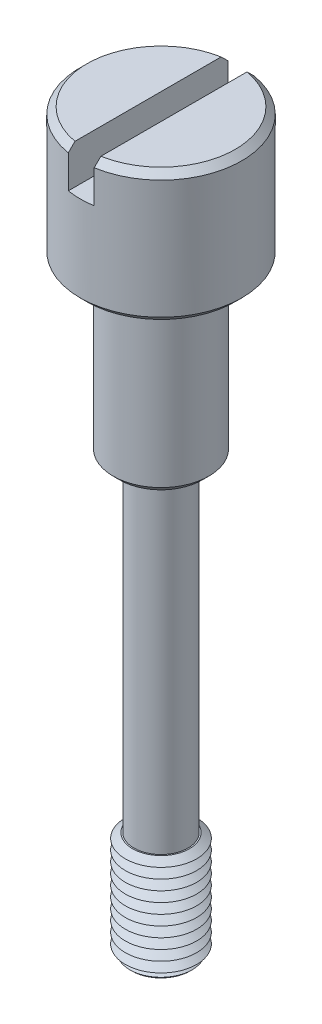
ISO-10303-21;
HEADER;
FILE_DESCRIPTION(('STEP AP214'),'2;1');
FILE_NAME('part.step','',(''),(''),'','','');
FILE_SCHEMA(('AUTOMOTIVE_DESIGN { 1 0 10303 214 1 1 1 1 }'));
ENDSEC;
DATA;
#1=APPLICATION_CONTEXT('core data for automotive mechanical design processes');
#2=APPLICATION_PROTOCOL_DEFINITION('international standard','automotive_design',2000,#1);
#3=PRODUCT_CONTEXT('',#1,'mechanical');
#4=PRODUCT('Part','Part','',(#3));
#5=PRODUCT_RELATED_PRODUCT_CATEGORY('part','',(#4));
#6=PRODUCT_DEFINITION_FORMATION('','',#4);
#7=PRODUCT_DEFINITION_CONTEXT('part definition',#1,'design');
#8=PRODUCT_DEFINITION('design','',#6,#7);
#9=PRODUCT_DEFINITION_SHAPE('','',#8);
#10=(LENGTH_UNIT() NAMED_UNIT(*) SI_UNIT(.MILLI.,.METRE.));
#11=(NAMED_UNIT(*) PLANE_ANGLE_UNIT() SI_UNIT($,.RADIAN.));
#12=(NAMED_UNIT(*) SI_UNIT($,.STERADIAN.) SOLID_ANGLE_UNIT());
#13=UNCERTAINTY_MEASURE_WITH_UNIT(LENGTH_MEASURE(1.E-05),#10,'distance_accuracy_value','');
#14=(GEOMETRIC_REPRESENTATION_CONTEXT(3) GLOBAL_UNCERTAINTY_ASSIGNED_CONTEXT((#13)) GLOBAL_UNIT_ASSIGNED_CONTEXT((#10,
#11,#12)) REPRESENTATION_CONTEXT('',''));
#15=CARTESIAN_POINT('',(0.,0.,0.));
#16=DIRECTION('',(0.,0.,1.));
#17=DIRECTION('',(1.,0.,0.));
#18=AXIS2_PLACEMENT_3D('',#15,#16,#17);
#19=CARTESIAN_POINT('',(0.,-25.7302,0.));
#20=DIRECTION('',(0.,-1.,0.));
#21=DIRECTION('',(0.,0.,-1.));
#22=AXIS2_PLACEMENT_3D('',#19,#20,#21);
#23=PLANE('',#22);
#24=CARTESIAN_POINT('',(0.,-25.7301999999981,0.));
#25=DIRECTION('',(0.,1.,0.));
#26=DIRECTION('',(0.,0.,1.));
#27=AXIS2_PLACEMENT_3D('',#24,#25,#26);
#28=CIRCLE('',#27,1.1175999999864);
#29=CARTESIAN_POINT('',(0.,-25.7301999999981,1.1175999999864));
#30=VERTEX_POINT('',#29);
#31=EDGE_CURVE('E19',#30,#30,#28,.T.);
#32=ORIENTED_EDGE('',*,*,#31,.F.);
#33=EDGE_LOOP('',(#32));
#34=FACE_BOUND('',#33,.T.);
#35=ADVANCED_FACE('F16',(#34),#23,.T.);
#36=CARTESIAN_POINT('',(0.,-25.6517066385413,0.));
#37=DIRECTION('',(0.,1.,0.));
#38=DIRECTION('',(0.,0.,1.));
#39=AXIS2_PLACEMENT_3D('',#36,#37,#38);
#40=CONICAL_SURFACE('',#39,1.19609336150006,0.785398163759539);
#41=ORIENTED_EDGE('',*,*,#31,.T.);
#42=EDGE_LOOP('',(#41));
#43=FACE_BOUND('',#42,.T.);
#44=CARTESIAN_POINT('',(0.,-25.6517066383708,0.));
#45=DIRECTION('',(0.,-1.,0.));
#46=DIRECTION('',(0.,0.,-1.));
#47=AXIS2_PLACEMENT_3D('',#44,#45,#46);
#48=CIRCLE('',#47,1.1960933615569);
#49=CARTESIAN_POINT('',(0.,-25.6517066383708,-1.1960933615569));
#50=VERTEX_POINT('',#49);
#51=EDGE_CURVE('E353',#50,#50,#48,.F.);
#52=ORIENTED_EDGE('',*,*,#51,.F.);
#53=EDGE_LOOP('',(#52));
#54=FACE_BOUND('',#53,.T.);
#55=ADVANCED_FACE('F251',(#43,#54),#40,.T.);
#56=CARTESIAN_POINT('',(0.,-25.6517066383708,0.));
#57=DIRECTION('',(0.,-1.,0.));
#58=DIRECTION('',(0.,0.,-1.));
#59=AXIS2_PLACEMENT_3D('',#56,#57,#58);
#60=CONICAL_SURFACE('',#59,1.1960933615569,0.959931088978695);
#61=CARTESIAN_POINT('',(0.,-25.5789597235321,0.));
#62=DIRECTION('',(0.,1.,0.));
#63=DIRECTION('',(0.,0.,1.));
#64=AXIS2_PLACEMENT_3D('',#61,#62,#63);
#65=CIRCLE('',#64,1.09220000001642);
#66=CARTESIAN_POINT('',(0.,-25.5789597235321,1.09220000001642));
#67=VERTEX_POINT('',#66);
#68=EDGE_CURVE('E350',#67,#67,#65,.T.);
#69=ORIENTED_EDGE('',*,*,#68,.F.);
#70=EDGE_LOOP('',(#69));
#71=FACE_BOUND('',#70,.T.);
#72=ORIENTED_EDGE('',*,*,#51,.T.);
#73=EDGE_LOOP('',(#72));
#74=FACE_BOUND('',#73,.T.);
#75=ADVANCED_FACE('F248',(#71,#74),#60,.T.);
#76=CARTESIAN_POINT('',(0.,-25.383321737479,0.));
#77=DIRECTION('',(0.,1.,0.));
#78=DIRECTION('',(-1.,0.,0.));
#79=AXIS2_PLACEMENT_3D('',#76,#77,#78);
#80=CONICAL_SURFACE('',#79,1.3715999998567,0.959931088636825);
#81=ORIENTED_EDGE('',*,*,#68,.T.);
#82=EDGE_LOOP('',(#81));
#83=FACE_BOUND('',#82,.T.);
#84=CARTESIAN_POINT('',(0.,-25.3833217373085,0.));
#85=DIRECTION('',(0.,-1.,0.));
#86=DIRECTION('',(0.,0.,-1.));
#87=AXIS2_PLACEMENT_3D('',#84,#85,#86);
#88=CIRCLE('',#87,1.37159999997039);
#89=CARTESIAN_POINT('',(0.,-25.3833217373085,-1.37159999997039));
#90=VERTEX_POINT('',#89);
#91=EDGE_CURVE('E347',#90,#90,#88,.F.);
#92=ORIENTED_EDGE('',*,*,#91,.F.);
#93=EDGE_LOOP('',(#92));
#94=FACE_BOUND('',#93,.T.);
#95=ADVANCED_FACE('F244',(#83,#94),#80,.T.);
#96=CARTESIAN_POINT('',(0.,-25.3833217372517,0.));
#97=DIRECTION('',(0.,-1.,0.));
#98=DIRECTION('',(0.,0.,-1.));
#99=AXIS2_PLACEMENT_3D('',#96,#97,#98);
#100=CONICAL_SURFACE('',#99,1.3715999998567,0.959931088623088);
#101=CARTESIAN_POINT('',(0.,-25.1876837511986,0.));
#102=DIRECTION('',(0.,1.,0.));
#103=DIRECTION('',(0.,0.,1.));
#104=AXIS2_PLACEMENT_3D('',#101,#102,#103);
#105=CIRCLE('',#104,1.09219999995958);
#106=CARTESIAN_POINT('',(0.,-25.1876837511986,1.09219999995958));
#107=VERTEX_POINT('',#106);
#108=EDGE_CURVE('E344',#107,#107,#105,.T.);
#109=ORIENTED_EDGE('',*,*,#108,.F.);
#110=EDGE_LOOP('',(#109));
#111=FACE_BOUND('',#110,.T.);
#112=ORIENTED_EDGE('',*,*,#91,.T.);
#113=EDGE_LOOP('',(#112));
#114=FACE_BOUND('',#113,.T.);
#115=ADVANCED_FACE('F240',(#111,#114),#100,.T.);
#116=CARTESIAN_POINT('',(0.,-24.9920457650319,0.));
#117=DIRECTION('',(0.,1.,0.));
#118=DIRECTION('',(0.,0.,1.));
#119=AXIS2_PLACEMENT_3D('',#116,#117,#118);
#120=CONICAL_SURFACE('',#119,1.37159999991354,0.959931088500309);
#121=ORIENTED_EDGE('',*,*,#108,.T.);
#122=EDGE_LOOP('',(#121));
#123=FACE_BOUND('',#122,.T.);
#124=CARTESIAN_POINT('',(0.,-24.992045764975,0.));
#125=DIRECTION('',(0.,-1.,0.));
#126=DIRECTION('',(0.,0.,-1.));
#127=AXIS2_PLACEMENT_3D('',#124,#125,#126);
#128=CIRCLE('',#127,1.37160000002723);
#129=CARTESIAN_POINT('',(0.,-24.992045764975,-1.37160000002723));
#130=VERTEX_POINT('',#129);
#131=EDGE_CURVE('E341',#130,#130,#128,.F.);
#132=ORIENTED_EDGE('',*,*,#131,.F.);
#133=EDGE_LOOP('',(#132));
#134=FACE_BOUND('',#133,.T.);
#135=ADVANCED_FACE('F236',(#123,#134),#120,.T.);
#136=CARTESIAN_POINT('',(0.,-24.9920457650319,0.));
#137=DIRECTION('',(0.,-1.,0.));
#138=DIRECTION('',(0.,0.,-1.));
#139=AXIS2_PLACEMENT_3D('',#136,#137,#138);
#140=CONICAL_SURFACE('',#139,1.37160000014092,0.959931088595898);
#141=CARTESIAN_POINT('',(0.,-24.7964077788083,0.));
#142=DIRECTION('',(0.,1.,0.));
#143=DIRECTION('',(0.,0.,1.));
#144=AXIS2_PLACEMENT_3D('',#141,#142,#143);
#145=CIRCLE('',#144,1.09220000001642);
#146=CARTESIAN_POINT('',(0.,-24.7964077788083,1.09220000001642));
#147=VERTEX_POINT('',#146);
#148=EDGE_CURVE('E338',#147,#147,#145,.T.);
#149=ORIENTED_EDGE('',*,*,#148,.F.);
#150=EDGE_LOOP('',(#149));
#151=FACE_BOUND('',#150,.T.);
#152=ORIENTED_EDGE('',*,*,#131,.T.);
#153=EDGE_LOOP('',(#152));
#154=FACE_BOUND('',#153,.T.);
#155=ADVANCED_FACE('F232',(#151,#154),#140,.T.);
#156=CARTESIAN_POINT('',(0.,-24.6007697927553,0.));
#157=DIRECTION('',(0.,1.,0.));
#158=DIRECTION('',(0.,0.,1.));
#159=AXIS2_PLACEMENT_3D('',#156,#157,#158);
#160=CONICAL_SURFACE('',#159,1.3715999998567,0.959931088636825);
#161=ORIENTED_EDGE('',*,*,#148,.T.);
#162=EDGE_LOOP('',(#161));
#163=FACE_BOUND('',#162,.T.);
#164=CARTESIAN_POINT('',(0.,-24.6007697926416,0.));
#165=DIRECTION('',(0.,-1.,0.));
#166=DIRECTION('',(0.,0.,-1.));
#167=AXIS2_PLACEMENT_3D('',#164,#165,#166);
#168=CIRCLE('',#167,1.37160000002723);
#169=CARTESIAN_POINT('',(0.,-24.6007697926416,-1.37160000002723));
#170=VERTEX_POINT('',#169);
#171=EDGE_CURVE('E335',#170,#170,#168,.F.);
#172=ORIENTED_EDGE('',*,*,#171,.F.);
#173=EDGE_LOOP('',(#172));
#174=FACE_BOUND('',#173,.T.);
#175=ADVANCED_FACE('F228',(#163,#174),#160,.T.);
#176=CARTESIAN_POINT('',(0.,-24.6007697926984,0.));
#177=DIRECTION('',(0.,-1.,0.));
#178=DIRECTION('',(1.,0.,0.));
#179=AXIS2_PLACEMENT_3D('',#176,#177,#178);
#180=CONICAL_SURFACE('',#179,1.37160000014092,0.959931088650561);
#181=CARTESIAN_POINT('',(0.,-24.4051318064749,0.));
#182=DIRECTION('',(0.,1.,0.));
#183=DIRECTION('',(0.,0.,1.));
#184=AXIS2_PLACEMENT_3D('',#181,#182,#183);
#185=CIRCLE('',#184,1.09220000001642);
#186=CARTESIAN_POINT('',(0.,-24.4051318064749,1.09220000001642));
#187=VERTEX_POINT('',#186);
#188=EDGE_CURVE('E332',#187,#187,#185,.T.);
#189=ORIENTED_EDGE('',*,*,#188,.F.);
#190=EDGE_LOOP('',(#189));
#191=FACE_BOUND('',#190,.T.);
#192=ORIENTED_EDGE('',*,*,#171,.T.);
#193=EDGE_LOOP('',(#192));
#194=FACE_BOUND('',#193,.T.);
#195=ADVANCED_FACE('F224',(#191,#194),#180,.T.);
#196=CARTESIAN_POINT('',(0.,-24.2094938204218,0.));
#197=DIRECTION('',(0.,1.,0.));
#198=DIRECTION('',(0.,0.,1.));
#199=AXIS2_PLACEMENT_3D('',#196,#197,#198);
#200=CONICAL_SURFACE('',#199,1.3715999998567,0.959931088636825);
#201=ORIENTED_EDGE('',*,*,#188,.T.);
#202=EDGE_LOOP('',(#201));
#203=FACE_BOUND('',#202,.T.);
#204=CARTESIAN_POINT('',(0.,-24.2094938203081,0.));
#205=DIRECTION('',(0.,-1.,0.));
#206=DIRECTION('',(0.,0.,-1.));
#207=AXIS2_PLACEMENT_3D('',#204,#205,#206);
#208=CIRCLE('',#207,1.37160000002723);
#209=CARTESIAN_POINT('',(0.,-24.2094938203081,-1.37160000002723));
#210=VERTEX_POINT('',#209);
#211=EDGE_CURVE('E329',#210,#210,#208,.F.);
#212=ORIENTED_EDGE('',*,*,#211,.F.);
#213=EDGE_LOOP('',(#212));
#214=FACE_BOUND('',#213,.T.);
#215=ADVANCED_FACE('F220',(#203,#214),#200,.T.);
#216=CARTESIAN_POINT('',(0.,-24.209493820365,0.));
#217=DIRECTION('',(0.,-1.,0.));
#218=DIRECTION('',(0.,0.,-1.));
#219=AXIS2_PLACEMENT_3D('',#216,#217,#218);
#220=CONICAL_SURFACE('',#219,1.37160000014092,0.959931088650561);
#221=CARTESIAN_POINT('',(0.,-24.0138558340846,0.));
#222=DIRECTION('',(0.,1.,0.));
#223=DIRECTION('',(0.,0.,1.));
#224=AXIS2_PLACEMENT_3D('',#221,#222,#223);
#225=CIRCLE('',#224,1.09220000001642);
#226=CARTESIAN_POINT('',(0.,-24.0138558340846,1.09220000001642));
#227=VERTEX_POINT('',#226);
#228=EDGE_CURVE('E326',#227,#227,#225,.T.);
#229=ORIENTED_EDGE('',*,*,#228,.F.);
#230=EDGE_LOOP('',(#229));
#231=FACE_BOUND('',#230,.T.);
#232=ORIENTED_EDGE('',*,*,#211,.T.);
#233=EDGE_LOOP('',(#232));
#234=FACE_BOUND('',#233,.T.);
#235=ADVANCED_FACE('F216',(#231,#234),#220,.T.);
#236=CARTESIAN_POINT('',(0.,-23.8182178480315,0.));
#237=DIRECTION('',(0.,1.,0.));
#238=DIRECTION('',(0.,0.,1.));
#239=AXIS2_PLACEMENT_3D('',#236,#237,#238);
#240=CONICAL_SURFACE('',#239,1.3715999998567,0.959931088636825);
#241=ORIENTED_EDGE('',*,*,#228,.T.);
#242=EDGE_LOOP('',(#241));
#243=FACE_BOUND('',#242,.T.);
#244=CARTESIAN_POINT('',(0.,-23.8182178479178,0.));
#245=DIRECTION('',(0.,-1.,0.));
#246=DIRECTION('',(0.,0.,-1.));
#247=AXIS2_PLACEMENT_3D('',#244,#245,#246);
#248=CIRCLE('',#247,1.37160000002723);
#249=CARTESIAN_POINT('',(0.,-23.8182178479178,-1.37160000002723));
#250=VERTEX_POINT('',#249);
#251=EDGE_CURVE('E323',#250,#250,#248,.F.);
#252=ORIENTED_EDGE('',*,*,#251,.F.);
#253=EDGE_LOOP('',(#252));
#254=FACE_BOUND('',#253,.T.);
#255=ADVANCED_FACE('F212',(#243,#254),#240,.T.);
#256=CARTESIAN_POINT('',(0.,-23.8182178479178,0.));
#257=DIRECTION('',(0.,-1.,0.));
#258=DIRECTION('',(1.,0.,0.));
#259=AXIS2_PLACEMENT_3D('',#256,#257,#258);
#260=CONICAL_SURFACE('',#259,1.37160000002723,0.959931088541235);
#261=CARTESIAN_POINT('',(0.,-23.6225798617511,0.));
#262=DIRECTION('',(0.,1.,0.));
#263=DIRECTION('',(0.,0.,1.));
#264=AXIS2_PLACEMENT_3D('',#261,#262,#263);
#265=CIRCLE('',#264,1.09220000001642);
#266=CARTESIAN_POINT('',(0.,-23.6225798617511,1.09220000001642));
#267=VERTEX_POINT('',#266);
#268=EDGE_CURVE('E320',#267,#267,#265,.T.);
#269=ORIENTED_EDGE('',*,*,#268,.F.);
#270=EDGE_LOOP('',(#269));
#271=FACE_BOUND('',#270,.T.);
#272=ORIENTED_EDGE('',*,*,#251,.T.);
#273=EDGE_LOOP('',(#272));
#274=FACE_BOUND('',#273,.T.);
#275=ADVANCED_FACE('F208',(#271,#274),#260,.T.);
#276=CARTESIAN_POINT('',(0.,-23.4269418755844,0.));
#277=DIRECTION('',(0.,1.,0.));
#278=DIRECTION('',(0.,0.,1.));
#279=AXIS2_PLACEMENT_3D('',#276,#277,#278);
#280=CONICAL_SURFACE('',#279,1.37160000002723,0.959931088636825);
#281=ORIENTED_EDGE('',*,*,#268,.T.);
#282=EDGE_LOOP('',(#281));
#283=FACE_BOUND('',#282,.T.);
#284=CARTESIAN_POINT('',(0.,-23.4269418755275,0.));
#285=DIRECTION('',(0.,-1.,0.));
#286=DIRECTION('',(0.,0.,-1.));
#287=AXIS2_PLACEMENT_3D('',#284,#285,#286);
#288=CIRCLE('',#287,1.37159999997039);
#289=CARTESIAN_POINT('',(0.,-23.4269418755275,-1.37159999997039));
#290=VERTEX_POINT('',#289);
#291=EDGE_CURVE('E317',#290,#290,#288,.F.);
#292=ORIENTED_EDGE('',*,*,#291,.F.);
#293=EDGE_LOOP('',(#292));
#294=FACE_BOUND('',#293,.T.);
#295=ADVANCED_FACE('F204',(#283,#294),#280,.T.);
#296=CARTESIAN_POINT('',(0.,-23.4269418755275,0.));
#297=DIRECTION('',(0.,-1.,0.));
#298=DIRECTION('',(0.,0.,-1.));
#299=AXIS2_PLACEMENT_3D('',#296,#297,#298);
#300=CONICAL_SURFACE('',#299,1.37159999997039,0.959931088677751);
#301=CARTESIAN_POINT('',(0.,-23.2313038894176,0.));
#302=DIRECTION('',(0.,1.,0.));
#303=DIRECTION('',(0.,0.,1.));
#304=AXIS2_PLACEMENT_3D('',#301,#302,#303);
#305=CIRCLE('',#304,1.09220000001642);
#306=CARTESIAN_POINT('',(0.,-23.2313038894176,1.09220000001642));
#307=VERTEX_POINT('',#306);
#308=EDGE_CURVE('E314',#307,#307,#305,.T.);
#309=ORIENTED_EDGE('',*,*,#308,.F.);
#310=EDGE_LOOP('',(#309));
#311=FACE_BOUND('',#310,.T.);
#312=ORIENTED_EDGE('',*,*,#291,.T.);
#313=EDGE_LOOP('',(#312));
#314=FACE_BOUND('',#313,.T.);
#315=ADVANCED_FACE('F200',(#311,#314),#300,.T.);
#316=CARTESIAN_POINT('',(0.,-23.0356659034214,0.));
#317=DIRECTION('',(0.,1.,0.));
#318=DIRECTION('',(0.,0.,1.));
#319=AXIS2_PLACEMENT_3D('',#316,#317,#318);
#320=CONICAL_SURFACE('',#319,1.37159999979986,0.959931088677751);
#321=ORIENTED_EDGE('',*,*,#308,.T.);
#322=EDGE_LOOP('',(#321));
#323=FACE_BOUND('',#322,.T.);
#324=CARTESIAN_POINT('',(0.,-23.0356659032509,0.));
#325=DIRECTION('',(0.,-1.,0.));
#326=DIRECTION('',(0.,0.,-1.));
#327=AXIS2_PLACEMENT_3D('',#324,#325,#326);
#328=CIRCLE('',#327,1.37159999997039);
#329=CARTESIAN_POINT('',(0.,-23.0356659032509,-1.37159999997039));
#330=VERTEX_POINT('',#329);
#331=EDGE_CURVE('E311',#330,#330,#328,.F.);
#332=ORIENTED_EDGE('',*,*,#331,.F.);
#333=EDGE_LOOP('',(#332));
#334=FACE_BOUND('',#333,.T.);
#335=ADVANCED_FACE('F196',(#323,#334),#320,.T.);
#336=CARTESIAN_POINT('',(0.,-23.0356659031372,0.));
#337=DIRECTION('',(0.,-1.,0.));
#338=DIRECTION('',(0.,0.,-1.));
#339=AXIS2_PLACEMENT_3D('',#336,#337,#338);
#340=CONICAL_SURFACE('',#339,1.37159999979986,0.959931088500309);
#341=CARTESIAN_POINT('',(0.,-22.8400279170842,0.));
#342=DIRECTION('',(0.,1.,0.));
#343=DIRECTION('',(0.,0.,1.));
#344=AXIS2_PLACEMENT_3D('',#341,#342,#343);
#345=CIRCLE('',#344,1.09219999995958);
#346=CARTESIAN_POINT('',(0.,-22.8400279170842,1.09219999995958));
#347=VERTEX_POINT('',#346);
#348=EDGE_CURVE('E308',#347,#347,#345,.T.);
#349=ORIENTED_EDGE('',*,*,#348,.F.);
#350=EDGE_LOOP('',(#349));
#351=FACE_BOUND('',#350,.T.);
#352=ORIENTED_EDGE('',*,*,#331,.T.);
#353=EDGE_LOOP('',(#352));
#354=FACE_BOUND('',#353,.T.);
#355=ADVANCED_FACE('F192',(#351,#354),#340,.T.);
#356=CARTESIAN_POINT('',(0.,-22.6443899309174,0.));
#357=DIRECTION('',(0.,1.,0.));
#358=DIRECTION('',(0.,0.,1.));
#359=AXIS2_PLACEMENT_3D('',#356,#357,#358);
#360=CONICAL_SURFACE('',#359,1.37159999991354,0.959931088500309);
#361=ORIENTED_EDGE('',*,*,#348,.T.);
#362=EDGE_LOOP('',(#361));
#363=FACE_BOUND('',#362,.T.);
#364=CARTESIAN_POINT('',(0.,-22.6443899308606,0.));
#365=DIRECTION('',(0.,-1.,0.));
#366=DIRECTION('',(0.,0.,-1.));
#367=AXIS2_PLACEMENT_3D('',#364,#365,#366);
#368=CIRCLE('',#367,1.37160000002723);
#369=CARTESIAN_POINT('',(0.,-22.6443899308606,-1.37160000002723));
#370=VERTEX_POINT('',#369);
#371=EDGE_CURVE('E305',#370,#370,#368,.F.);
#372=ORIENTED_EDGE('',*,*,#371,.F.);
#373=EDGE_LOOP('',(#372));
#374=FACE_BOUND('',#373,.T.);
#375=ADVANCED_FACE('F188',(#363,#374),#360,.T.);
#376=CARTESIAN_POINT('',(0.,-22.6443899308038,0.));
#377=DIRECTION('',(0.,-1.,0.));
#378=DIRECTION('',(0.,0.,-1.));
#379=AXIS2_PLACEMENT_3D('',#376,#377,#378);
#380=CONICAL_SURFACE('',#379,1.37159999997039,0.959931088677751);
#381=CARTESIAN_POINT('',(0.,-22.4487519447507,0.));
#382=DIRECTION('',(0.,1.,0.));
#383=DIRECTION('',(0.,0.,1.));
#384=AXIS2_PLACEMENT_3D('',#381,#382,#383);
#385=CIRCLE('',#384,1.09220000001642);
#386=CARTESIAN_POINT('',(0.,-22.4487519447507,1.09220000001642));
#387=VERTEX_POINT('',#386);
#388=EDGE_CURVE('E302',#387,#387,#385,.T.);
#389=ORIENTED_EDGE('',*,*,#388,.F.);
#390=EDGE_LOOP('',(#389));
#391=FACE_BOUND('',#390,.T.);
#392=ORIENTED_EDGE('',*,*,#371,.T.);
#393=EDGE_LOOP('',(#392));
#394=FACE_BOUND('',#393,.T.);
#395=ADVANCED_FACE('F184',(#391,#394),#380,.T.);
#396=CARTESIAN_POINT('',(0.,-22.2531139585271,0.));
#397=DIRECTION('',(0.,1.,0.));
#398=DIRECTION('',(0.,0.,1.));
#399=AXIS2_PLACEMENT_3D('',#396,#397,#398);
#400=CONICAL_SURFACE('',#399,1.37160000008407,0.959931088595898);
#401=ORIENTED_EDGE('',*,*,#388,.T.);
#402=EDGE_LOOP('',(#401));
#403=FACE_BOUND('',#402,.T.);
#404=CARTESIAN_POINT('',(0.,-22.253113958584,0.));
#405=DIRECTION('',(0.,-1.,0.));
#406=DIRECTION('',(0.,0.,-1.));
#407=AXIS2_PLACEMENT_3D('',#404,#405,#406);
#408=CIRCLE('',#407,1.37160000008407);
#409=CARTESIAN_POINT('',(0.,-22.253113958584,-1.37160000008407));
#410=VERTEX_POINT('',#409);
#411=EDGE_CURVE('E299',#410,#410,#408,.F.);
#412=ORIENTED_EDGE('',*,*,#411,.F.);
#413=EDGE_LOOP('',(#412));
#414=FACE_BOUND('',#413,.T.);
#415=ADVANCED_FACE('F180',(#403,#414),#400,.T.);
#416=CARTESIAN_POINT('',(0.,-22.2531139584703,0.));
#417=DIRECTION('',(0.,-1.,0.));
#418=DIRECTION('',(0.,0.,-1.));
#419=AXIS2_PLACEMENT_3D('',#416,#417,#418);
#420=CONICAL_SURFACE('',#419,1.3715999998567,0.959931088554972);
#421=CARTESIAN_POINT('',(0.,-22.0574759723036,0.));
#422=DIRECTION('',(0.,1.,0.));
#423=DIRECTION('',(0.,0.,1.));
#424=AXIS2_PLACEMENT_3D('',#421,#422,#423);
#425=CIRCLE('',#424,1.09220000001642);
#426=CARTESIAN_POINT('',(0.,-22.0574759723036,1.09220000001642));
#427=VERTEX_POINT('',#426);
#428=EDGE_CURVE('E296',#427,#427,#425,.T.);
#429=ORIENTED_EDGE('',*,*,#428,.F.);
#430=EDGE_LOOP('',(#429));
#431=FACE_BOUND('',#430,.T.);
#432=ORIENTED_EDGE('',*,*,#411,.T.);
#433=EDGE_LOOP('',(#432));
#434=FACE_BOUND('',#433,.T.);
#435=ADVANCED_FACE('F176',(#431,#434),#420,.T.);
#436=CARTESIAN_POINT('',(0.,-21.8618379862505,0.));
#437=DIRECTION('',(0.,1.,0.));
#438=DIRECTION('',(0.,0.,1.));
#439=AXIS2_PLACEMENT_3D('',#436,#437,#438);
#440=CONICAL_SURFACE('',#439,1.3715999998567,0.959931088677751);
#441=ORIENTED_EDGE('',*,*,#428,.T.);
#442=EDGE_LOOP('',(#441));
#443=FACE_BOUND('',#442,.T.);
#444=CARTESIAN_POINT('',(0.,-21.8618379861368,0.));
#445=DIRECTION('',(0.,-1.,0.));
#446=DIRECTION('',(0.,0.,-1.));
#447=AXIS2_PLACEMENT_3D('',#444,#445,#446);
#448=CIRCLE('',#447,1.37160000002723);
#449=CARTESIAN_POINT('',(0.,-21.8618379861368,-1.37160000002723));
#450=VERTEX_POINT('',#449);
#451=EDGE_CURVE('E292',#450,#450,#448,.F.);
#452=ORIENTED_EDGE('',*,*,#451,.F.);
#453=EDGE_LOOP('',(#452));
#454=FACE_BOUND('',#453,.T.);
#455=ADVANCED_FACE('F172',(#443,#454),#440,.T.);
#456=CARTESIAN_POINT('',(0.,-21.8618379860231,0.));
#457=DIRECTION('',(0.,-1.,0.));
#458=DIRECTION('',(0.,0.,-1.));
#459=AXIS2_PLACEMENT_3D('',#456,#457,#458);
#460=CONICAL_SURFACE('',#459,1.3715999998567,0.959931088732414);
#461=CARTESIAN_POINT('',(0.,-21.6662000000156,0.));
#462=DIRECTION('',(0.,-1.,0.));
#463=DIRECTION('',(0.,0.,-1.));
#464=AXIS2_PLACEMENT_3D('',#461,#462,#463);
#465=CIRCLE('',#464,1.09220000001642);
#466=CARTESIAN_POINT('',(0.,-21.6662000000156,-1.09220000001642));
#467=VERTEX_POINT('',#466);
#468=EDGE_CURVE('E295',#467,#467,#465,.T.);
#469=ORIENTED_EDGE('',*,*,#468,.T.);
#470=EDGE_LOOP('',(#469));
#471=FACE_BOUND('',#470,.T.);
#472=ORIENTED_EDGE('',*,*,#451,.T.);
#473=EDGE_LOOP('',(#472));
#474=FACE_BOUND('',#473,.T.);
#475=ADVANCED_FACE('F168',(#471,#474),#460,.T.);
#476=CARTESIAN_POINT('',(0.,-21.6662,0.));
#477=DIRECTION('',(0.,-1.,0.));
#478=DIRECTION('',(0.,0.,-1.));
#479=AXIS2_PLACEMENT_3D('',#476,#477,#478);
#480=PLANE('',#479);
#481=CARTESIAN_POINT('',(0.,-21.6662,0.));
#482=DIRECTION('',(0.,1.,0.));
#483=DIRECTION('',(0.,0.,1.));
#484=AXIS2_PLACEMENT_3D('',#481,#482,#483);
#485=CIRCLE('',#484,1.0414);
#486=CARTESIAN_POINT('',(0.,-21.6662,1.0414));
#487=VERTEX_POINT('',#486);
#488=EDGE_CURVE('E662',#487,#487,#485,.T.);
#489=ORIENTED_EDGE('',*,*,#488,.F.);
#490=EDGE_LOOP('',(#489));
#491=FACE_BOUND('',#490,.T.);
#492=ORIENTED_EDGE('',*,*,#468,.F.);
#493=EDGE_LOOP('',(#492));
#494=FACE_BOUND('',#493,.T.);
#495=ADVANCED_FACE('F164',(#491,#494),#480,.F.);
#496=CARTESIAN_POINT('',(0.,-21.6662,0.));
#497=DIRECTION('',(0.,1.,0.));
#498=DIRECTION('',(0.,0.,1.));
#499=AXIS2_PLACEMENT_3D('',#496,#497,#498);
#500=CYLINDRICAL_SURFACE('',#499,1.0414);
#501=CARTESIAN_POINT('',(0.,-9.1186,0.));
#502=DIRECTION('',(0.,1.,0.));
#503=DIRECTION('',(0.,0.,1.));
#504=AXIS2_PLACEMENT_3D('',#501,#502,#503);
#505=CIRCLE('',#504,1.0414);
#506=CARTESIAN_POINT('',(0.,-9.1186,1.0414));
#507=VERTEX_POINT('',#506);
#508=EDGE_CURVE('E665',#507,#507,#505,.T.);
#509=ORIENTED_EDGE('',*,*,#508,.F.);
#510=EDGE_LOOP('',(#509));
#511=FACE_BOUND('',#510,.T.);
#512=ORIENTED_EDGE('',*,*,#488,.T.);
#513=EDGE_LOOP('',(#512));
#514=FACE_BOUND('',#513,.T.);
#515=ADVANCED_FACE('F160',(#511,#514),#500,.T.);
#516=CARTESIAN_POINT('',(0.,-9.1186,0.));
#517=DIRECTION('',(0.,-1.,0.));
#518=DIRECTION('',(0.,0.,-1.));
#519=AXIS2_PLACEMENT_3D('',#516,#517,#518);
#520=PLANE('',#519);
#521=ORIENTED_EDGE('',*,*,#508,.T.);
#522=EDGE_LOOP('',(#521));
#523=FACE_BOUND('',#522,.T.);
#524=CARTESIAN_POINT('',(0.,-9.11860000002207,0.));
#525=DIRECTION('',(0.,1.,0.));
#526=DIRECTION('',(0.,0.,1.));
#527=AXIS2_PLACEMENT_3D('',#524,#525,#526);
#528=CIRCLE('',#527,1.58750000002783);
#529=CARTESIAN_POINT('',(0.,-9.11860000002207,1.58750000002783));
#530=VERTEX_POINT('',#529);
#531=EDGE_CURVE('E143',#530,#530,#528,.T.);
#532=ORIENTED_EDGE('',*,*,#531,.F.);
#533=EDGE_LOOP('',(#532));
#534=FACE_BOUND('',#533,.T.);
#535=ADVANCED_FACE('F156',(#523,#534),#520,.T.);
#536=CARTESIAN_POINT('',(0.,-8.86460000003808,0.));
#537=DIRECTION('',(0.,1.,0.));
#538=DIRECTION('',(0.,0.,1.));
#539=AXIS2_PLACEMENT_3D('',#536,#537,#538);
#540=CONICAL_SURFACE('',#539,1.84150000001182,0.785398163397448);
#541=ORIENTED_EDGE('',*,*,#531,.T.);
#542=EDGE_LOOP('',(#541));
#543=FACE_BOUND('',#542,.T.);
#544=CARTESIAN_POINT('',(0.,-8.8646,0.));
#545=DIRECTION('',(0.,1.,0.));
#546=DIRECTION('',(0.,0.,1.));
#547=AXIS2_PLACEMENT_3D('',#544,#545,#546);
#548=CIRCLE('',#547,1.8415);
#549=CARTESIAN_POINT('',(0.,-8.8646,1.8415));
#550=VERTEX_POINT('',#549);
#551=EDGE_CURVE('E276',#550,#550,#548,.T.);
#552=ORIENTED_EDGE('',*,*,#551,.F.);
#553=EDGE_LOOP('',(#552));
#554=FACE_BOUND('',#553,.T.);
#555=ADVANCED_FACE('F151',(#543,#554),#540,.T.);
#556=CARTESIAN_POINT('',(-0.499028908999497,1.016,3.30391553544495));
#557=DIRECTION('',(-1.,0.,0.));
#558=DIRECTION('',(0.,0.,1.));
#559=AXIS2_PLACEMENT_3D('',#556,#557,#558);
#560=PLANE('',#559);
#561=CARTESIAN_POINT('',(-0.499028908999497,2.28600000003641,3.0712216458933));
#562=CARTESIAN_POINT('',(-0.499028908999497,2.32835965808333,3.0283086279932));
#563=CARTESIAN_POINT('',(-0.499028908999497,2.37070615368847,2.98538263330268));
#564=CARTESIAN_POINT('',(-0.499028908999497,2.4553728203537,2.89950468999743));
#565=CARTESIAN_POINT('',(-0.499028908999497,2.49769299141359,2.85655274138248));
#566=CARTESIAN_POINT('',(-0.499028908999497,2.54000000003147,2.81358781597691));
#567=B_SPLINE_CURVE_WITH_KNOTS('',3,(#561,#562,#563,#564,#565,#566),.UNSPECIFIED.,.F.,.F.,(4,2,
4),(0.,0.180894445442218,0.361788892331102),.UNSPECIFIED.);
#568=CARTESIAN_POINT('',(-0.499028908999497,2.28600000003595,3.07122164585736));
#569=VERTEX_POINT('',#568);
#570=CARTESIAN_POINT('',(-0.499028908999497,2.54000000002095,2.8135878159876));
#571=VERTEX_POINT('',#570);
#572=EDGE_CURVE('E129',#569,#571,#567,.T.);
#573=ORIENTED_EDGE('',*,*,#572,.F.);
#574=DIRECTION('',(0.,1.,0.));
#575=VECTOR('',#574,1.);
#576=CARTESIAN_POINT('',(-0.499028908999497,1.016,3.07122164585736));
#577=LINE('',#576,#575);
#578=CARTESIAN_POINT('',(-0.499028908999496,1.016,3.07122164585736));
#579=VERTEX_POINT('',#578);
#580=EDGE_CURVE('E288',#579,#569,#577,.T.);
#581=ORIENTED_EDGE('',*,*,#580,.F.);
#582=DIRECTION('',(0.,0.,1.));
#583=VECTOR('',#582,1.);
#584=CARTESIAN_POINT('',(-0.499028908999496,1.016,-3.23508396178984));
#585=LINE('',#584,#583);
#586=CARTESIAN_POINT('',(-0.499028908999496,1.016,-3.07122164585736));
#587=VERTEX_POINT('',#586);
#588=EDGE_CURVE('E280',#587,#579,#585,.T.);
#589=ORIENTED_EDGE('',*,*,#588,.F.);
#590=DIRECTION('',(0.,1.,0.));
#591=VECTOR('',#590,1.);
#592=CARTESIAN_POINT('',(-0.499028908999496,1.016,-3.07122164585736));
#593=LINE('',#592,#591);
#594=CARTESIAN_POINT('',(-0.499028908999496,2.28600000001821,-3.07122164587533));
#595=VERTEX_POINT('',#594);
#596=EDGE_CURVE('E142',#595,#587,#593,.F.);
#597=ORIENTED_EDGE('',*,*,#596,.F.);
#598=CARTESIAN_POINT('',(-0.499028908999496,2.54000000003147,-2.81358781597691));
#599=CARTESIAN_POINT('',(-0.499028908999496,2.49769299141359,-2.85655274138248));
#600=CARTESIAN_POINT('',(-0.499028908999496,2.4553728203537,-2.89950468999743));
#601=CARTESIAN_POINT('',(-0.499028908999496,2.37070615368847,-2.98538263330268));
#602=CARTESIAN_POINT('',(-0.499028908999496,2.32835965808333,-3.0283086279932));
#603=CARTESIAN_POINT('',(-0.499028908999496,2.28600000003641,-3.0712216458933));
#604=B_SPLINE_CURVE_WITH_KNOTS('',3,(#598,#599,#600,#601,#602,#603),.UNSPECIFIED.,.F.,.F.,(4,2,
4),(0.,0.180894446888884,0.361788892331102),.UNSPECIFIED.);
#605=CARTESIAN_POINT('',(-0.499028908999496,2.54000000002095,-2.8135878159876));
#606=VERTEX_POINT('',#605);
#607=EDGE_CURVE('E67',#606,#595,#604,.T.);
#608=ORIENTED_EDGE('',*,*,#607,.F.);
#609=DIRECTION('',(0.,0.,1.));
#610=VECTOR('',#609,1.);
#611=CARTESIAN_POINT('',(-0.499028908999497,2.54,0.));
#612=LINE('',#611,#610);
#613=EDGE_CURVE('E275',#571,#606,#612,.F.);
#614=ORIENTED_EDGE('',*,*,#613,.F.);
#615=EDGE_LOOP('',(#573,#581,#589,#597,#608,#614));
#616=FACE_BOUND('',#615,.T.);
#617=ADVANCED_FACE('F145',(#616),#560,.F.);
#618=CARTESIAN_POINT('',(0.499028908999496,1.016,-3.23508396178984));
#619=DIRECTION('',(0.,1.,0.));
#620=DIRECTION('',(0.,0.,1.));
#621=AXIS2_PLACEMENT_3D('',#618,#619,#620);
#622=PLANE('',#621);
#623=CARTESIAN_POINT('',(0.,1.016,0.));
#624=DIRECTION('',(0.,-1.,0.));
#625=DIRECTION('',(0.,0.,-1.));
#626=AXIS2_PLACEMENT_3D('',#623,#624,#625);
#627=CIRCLE('',#626,3.1115);
#628=CARTESIAN_POINT('',(0.499028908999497,1.016,3.07122164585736));
#629=VERTEX_POINT('',#628);
#630=EDGE_CURVE('E283',#579,#629,#627,.F.);
#631=ORIENTED_EDGE('',*,*,#630,.T.);
#632=DIRECTION('',(0.,0.,-1.));
#633=VECTOR('',#632,1.);
#634=CARTESIAN_POINT('',(0.499028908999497,1.016,3.30391553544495));
#635=LINE('',#634,#633);
#636=CARTESIAN_POINT('',(0.499028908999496,1.016,-3.07122164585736));
#637=VERTEX_POINT('',#636);
#638=EDGE_CURVE('E80',#629,#637,#635,.T.);
#639=ORIENTED_EDGE('',*,*,#638,.T.);
#640=CARTESIAN_POINT('',(0.,1.016,0.));
#641=DIRECTION('',(0.,-1.,0.));
#642=DIRECTION('',(0.,0.,-1.));
#643=AXIS2_PLACEMENT_3D('',#640,#641,#642);
#644=CIRCLE('',#643,3.1115);
#645=EDGE_CURVE('E76',#637,#587,#644,.F.);
#646=ORIENTED_EDGE('',*,*,#645,.T.);
#647=ORIENTED_EDGE('',*,*,#588,.T.);
#648=EDGE_LOOP('',(#631,#639,#646,#647));
#649=FACE_BOUND('',#648,.T.);
#650=ADVANCED_FACE('F150',(#649),#622,.T.);
#651=CARTESIAN_POINT('',(0.,-9.1186,0.));
#652=DIRECTION('',(0.,1.,0.));
#653=DIRECTION('',(0.,0.,1.));
#654=AXIS2_PLACEMENT_3D('',#651,#652,#653);
#655=CYLINDRICAL_SURFACE('',#654,1.8415);
#656=ORIENTED_EDGE('',*,*,#551,.T.);
#657=EDGE_LOOP('',(#656));
#658=FACE_BOUND('',#657,.T.);
#659=CARTESIAN_POINT('',(0.,-2.54,0.));
#660=DIRECTION('',(0.,1.,0.));
#661=DIRECTION('',(0.,0.,1.));
#662=AXIS2_PLACEMENT_3D('',#659,#660,#661);
#663=CIRCLE('',#662,1.8415);
#664=CARTESIAN_POINT('',(0.,-2.54,1.8415));
#665=VERTEX_POINT('',#664);
#666=EDGE_CURVE('E88',#665,#665,#663,.F.);
#667=ORIENTED_EDGE('',*,*,#666,.T.);
#668=EDGE_LOOP('',(#667));
#669=FACE_BOUND('',#668,.T.);
#670=ADVANCED_FACE('F368',(#658,#669),#655,.T.);
#671=CARTESIAN_POINT('',(0.,2.54,0.));
#672=DIRECTION('',(0.,1.,0.));
#673=DIRECTION('',(0.,0.,1.));
#674=AXIS2_PLACEMENT_3D('',#671,#672,#673);
#675=PLANE('',#674);
#676=ORIENTED_EDGE('',*,*,#613,.T.);
#677=CARTESIAN_POINT('',(0.,2.54000000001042,0.));
#678=DIRECTION('',(0.,-1.,0.));
#679=DIRECTION('',(0.,0.,-1.));
#680=AXIS2_PLACEMENT_3D('',#677,#678,#679);
#681=CIRCLE('',#680,2.85750000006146);
#682=EDGE_CURVE('E91',#571,#606,#681,.T.);
#683=ORIENTED_EDGE('',*,*,#682,.F.);
#684=EDGE_LOOP('',(#676,#683));
#685=FACE_BOUND('',#684,.T.);
#686=ADVANCED_FACE('F362',(#685),#675,.T.);
#687=CARTESIAN_POINT('',(0.499028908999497,1.016,3.30391553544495));
#688=DIRECTION('',(1.,0.,0.));
#689=DIRECTION('',(0.,0.,-1.));
#690=AXIS2_PLACEMENT_3D('',#687,#688,#689);
#691=PLANE('',#690);
#692=CARTESIAN_POINT('',(0.499028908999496,2.28600000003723,-3.07122164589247));
#693=CARTESIAN_POINT('',(0.499028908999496,2.32835965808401,-3.02830862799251));
#694=CARTESIAN_POINT('',(0.499028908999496,2.37070615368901,-2.98538263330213));
#695=CARTESIAN_POINT('',(0.499028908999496,2.45537282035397,-2.89950468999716));
#696=CARTESIAN_POINT('',(0.499028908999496,2.49769299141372,-2.85655274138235));
#697=CARTESIAN_POINT('',(0.499028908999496,2.54000000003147,-2.81358781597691));
#698=B_SPLINE_CURVE_WITH_KNOTS('',3,(#692,#693,#694,#695,#696,#697),.UNSPECIFIED.,.F.,.F.,(4,2,
4),(0.,0.180894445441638,0.361788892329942),.UNSPECIFIED.);
#699=CARTESIAN_POINT('',(0.499028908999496,2.28600000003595,-3.07122164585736));
#700=VERTEX_POINT('',#699);
#701=CARTESIAN_POINT('',(0.499028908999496,2.54000000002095,-2.8135878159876));
#702=VERTEX_POINT('',#701);
#703=EDGE_CURVE('E34',#700,#702,#698,.T.);
#704=ORIENTED_EDGE('',*,*,#703,.F.);
#705=DIRECTION('',(0.,1.,0.));
#706=VECTOR('',#705,1.);
#707=CARTESIAN_POINT('',(0.499028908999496,1.016,-3.07122164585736));
#708=LINE('',#707,#706);
#709=EDGE_CURVE('E72',#637,#700,#708,.T.);
#710=ORIENTED_EDGE('',*,*,#709,.F.);
#711=ORIENTED_EDGE('',*,*,#638,.F.);
#712=DIRECTION('',(0.,1.,0.));
#713=VECTOR('',#712,1.);
#714=CARTESIAN_POINT('',(0.499028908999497,1.016,3.07122164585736));
#715=LINE('',#714,#713);
#716=CARTESIAN_POINT('',(0.499028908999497,2.28600000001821,3.07122164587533));
#717=VERTEX_POINT('',#716);
#718=EDGE_CURVE('E279',#717,#629,#715,.F.);
#719=ORIENTED_EDGE('',*,*,#718,.F.);
#720=CARTESIAN_POINT('',(0.499028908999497,2.54000000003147,2.81358781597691));
#721=CARTESIAN_POINT('',(0.499028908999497,2.49769299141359,2.85655274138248));
#722=CARTESIAN_POINT('',(0.499028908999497,2.4553728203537,2.89950468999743));
#723=CARTESIAN_POINT('',(0.499028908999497,2.37070615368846,2.98538263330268));
#724=CARTESIAN_POINT('',(0.499028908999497,2.32835965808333,3.0283086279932));
#725=CARTESIAN_POINT('',(0.499028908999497,2.28600000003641,3.0712216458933));
#726=B_SPLINE_CURVE_WITH_KNOTS('',3,(#720,#721,#722,#723,#724,#725),.UNSPECIFIED.,.F.,.F.,(4,2,
4),(0.,0.180894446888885,0.361788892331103),.UNSPECIFIED.);
#727=CARTESIAN_POINT('',(0.499028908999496,2.54000000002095,2.8135878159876));
#728=VERTEX_POINT('',#727);
#729=EDGE_CURVE('E83',#728,#717,#726,.T.);
#730=ORIENTED_EDGE('',*,*,#729,.F.);
#731=DIRECTION('',(0.,0.,1.));
#732=VECTOR('',#731,1.);
#733=CARTESIAN_POINT('',(0.499028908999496,2.54,0.));
#734=LINE('',#733,#732);
#735=EDGE_CURVE('E86',#702,#728,#734,.T.);
#736=ORIENTED_EDGE('',*,*,#735,.F.);
#737=EDGE_LOOP('',(#704,#710,#711,#719,#730,#736));
#738=FACE_BOUND('',#737,.T.);
#739=ADVANCED_FACE('F84',(#738),#691,.F.);
#740=CARTESIAN_POINT('',(0.,-2.54,0.));
#741=DIRECTION('',(0.,1.,0.));
#742=DIRECTION('',(0.,0.,1.));
#743=AXIS2_PLACEMENT_3D('',#740,#741,#742);
#744=PLANE('',#743);
#745=ORIENTED_EDGE('',*,*,#666,.F.);
#746=EDGE_LOOP('',(#745));
#747=FACE_BOUND('',#746,.T.);
#748=CARTESIAN_POINT('',(0.,-2.54000000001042,0.));
#749=DIRECTION('',(0.,1.,0.));
#750=DIRECTION('',(0.,0.,1.));
#751=AXIS2_PLACEMENT_3D('',#748,#749,#750);
#752=CIRCLE('',#751,2.85750000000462);
#753=CARTESIAN_POINT('',(0.,-2.54000000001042,2.85750000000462));
#754=VERTEX_POINT('',#753);
#755=EDGE_CURVE('E274',#754,#754,#752,.T.);
#756=ORIENTED_EDGE('',*,*,#755,.F.);
#757=EDGE_LOOP('',(#756));
#758=FACE_BOUND('',#757,.T.);
#759=ADVANCED_FACE('F125',(#747,#758),#744,.F.);
#760=CARTESIAN_POINT('',(0.,2.28600000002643,0.));
#761=DIRECTION('',(0.,-1.,0.));
#762=DIRECTION('',(0.,0.,-1.));
#763=AXIS2_PLACEMENT_3D('',#760,#761,#762);
#764=CONICAL_SURFACE('',#763,3.11150000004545,0.785398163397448);
#765=ORIENTED_EDGE('',*,*,#572,.T.);
#766=ORIENTED_EDGE('',*,*,#682,.T.);
#767=ORIENTED_EDGE('',*,*,#607,.T.);
#768=CARTESIAN_POINT('',(0.,2.286,0.));
#769=DIRECTION('',(0.,-1.,0.));
#770=DIRECTION('',(0.,0.,-1.));
#771=AXIS2_PLACEMENT_3D('',#768,#769,#770);
#772=CIRCLE('',#771,3.1115);
#773=EDGE_CURVE('E270',#569,#595,#772,.T.);
#774=ORIENTED_EDGE('',*,*,#773,.F.);
#775=EDGE_LOOP('',(#765,#766,#767,#774));
#776=FACE_BOUND('',#775,.T.);
#777=ADVANCED_FACE('F121',(#776),#764,.T.);
#778=CARTESIAN_POINT('',(0.,2.54,0.));
#779=DIRECTION('',(0.,1.,0.));
#780=DIRECTION('',(0.,0.,1.));
#781=AXIS2_PLACEMENT_3D('',#778,#779,#780);
#782=PLANE('',#781);
#783=ORIENTED_EDGE('',*,*,#735,.T.);
#784=CARTESIAN_POINT('',(0.,2.54000000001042,0.));
#785=DIRECTION('',(0.,-1.,0.));
#786=DIRECTION('',(0.,0.,-1.));
#787=AXIS2_PLACEMENT_3D('',#784,#785,#786);
#788=CIRCLE('',#787,2.85750000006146);
#789=EDGE_CURVE('E268',#702,#728,#788,.T.);
#790=ORIENTED_EDGE('',*,*,#789,.F.);
#791=EDGE_LOOP('',(#783,#790));
#792=FACE_BOUND('',#791,.T.);
#793=ADVANCED_FACE('F117',(#792),#782,.T.);
#794=CARTESIAN_POINT('',(0.,-2.28600000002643,0.));
#795=DIRECTION('',(0.,1.,0.));
#796=DIRECTION('',(0.,0.,1.));
#797=AXIS2_PLACEMENT_3D('',#794,#795,#796);
#798=CONICAL_SURFACE('',#797,3.11149999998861,0.785398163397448);
#799=CARTESIAN_POINT('',(0.,-2.28600000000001,0.));
#800=DIRECTION('',(0.,-1.,0.));
#801=DIRECTION('',(0.,0.,-1.));
#802=AXIS2_PLACEMENT_3D('',#799,#800,#801);
#803=CIRCLE('',#802,3.1115);
#804=CARTESIAN_POINT('',(0.,-2.28600000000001,-3.1115));
#805=VERTEX_POINT('',#804);
#806=EDGE_CURVE('E25',#805,#805,#803,.F.);
#807=ORIENTED_EDGE('',*,*,#806,.F.);
#808=EDGE_LOOP('',(#807));
#809=FACE_BOUND('',#808,.T.);
#810=ORIENTED_EDGE('',*,*,#755,.T.);
#811=EDGE_LOOP('',(#810));
#812=FACE_BOUND('',#811,.T.);
#813=ADVANCED_FACE('F113',(#809,#812),#798,.T.);
#814=CARTESIAN_POINT('',(0.,2.28600000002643,0.));
#815=DIRECTION('',(0.,-1.,0.));
#816=DIRECTION('',(0.,0.,-1.));
#817=AXIS2_PLACEMENT_3D('',#814,#815,#816);
#818=CONICAL_SURFACE('',#817,3.11150000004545,0.785398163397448);
#819=ORIENTED_EDGE('',*,*,#703,.T.);
#820=ORIENTED_EDGE('',*,*,#789,.T.);
#821=ORIENTED_EDGE('',*,*,#729,.T.);
#822=CARTESIAN_POINT('',(0.,2.286,0.));
#823=DIRECTION('',(0.,-1.,0.));
#824=DIRECTION('',(0.,0.,-1.));
#825=AXIS2_PLACEMENT_3D('',#822,#823,#824);
#826=CIRCLE('',#825,3.1115);
#827=EDGE_CURVE('E11',#700,#717,#826,.T.);
#828=ORIENTED_EDGE('',*,*,#827,.F.);
#829=EDGE_LOOP('',(#819,#820,#821,#828));
#830=FACE_BOUND('',#829,.T.);
#831=ADVANCED_FACE('F82',(#830),#818,.T.);
#832=CARTESIAN_POINT('',(0.,2.54,0.));
#833=DIRECTION('',(0.,-1.,0.));
#834=DIRECTION('',(0.,0.,-1.));
#835=AXIS2_PLACEMENT_3D('',#832,#833,#834);
#836=CYLINDRICAL_SURFACE('',#835,3.1115);
#837=ORIENTED_EDGE('',*,*,#806,.T.);
#838=EDGE_LOOP('',(#837));
#839=FACE_BOUND('',#838,.T.);
#840=ORIENTED_EDGE('',*,*,#827,.T.);
#841=ORIENTED_EDGE('',*,*,#718,.T.);
#842=ORIENTED_EDGE('',*,*,#630,.F.);
#843=ORIENTED_EDGE('',*,*,#580,.T.);
#844=ORIENTED_EDGE('',*,*,#773,.T.);
#845=ORIENTED_EDGE('',*,*,#596,.T.);
#846=ORIENTED_EDGE('',*,*,#645,.F.);
#847=ORIENTED_EDGE('',*,*,#709,.T.);
#848=EDGE_LOOP('',(#840,#841,#842,#843,#844,#845,#846,#847));
#849=FACE_BOUND('',#848,.T.);
#850=ADVANCED_FACE('F73',(#839,#849),#836,.T.);
#851=CLOSED_SHELL('',(#35,#55,#75,#95,#115,#135,#155,#175,#195,#215,#235,#255,#275,#295,#315,
#335,#355,#375,#395,#415,#435,#455,#475,#495,#515,#535,#555,#617,#650,#670,#686,#739,#759,#777,
#793,#813,#831,#850));
#852=MANIFOLD_SOLID_BREP('B1',#851);
#853=ADVANCED_BREP_SHAPE_REPRESENTATION('',(#18,#852),#14);
#854=SHAPE_DEFINITION_REPRESENTATION(#9,#853);
ENDSEC;
END-ISO-10303-21;
